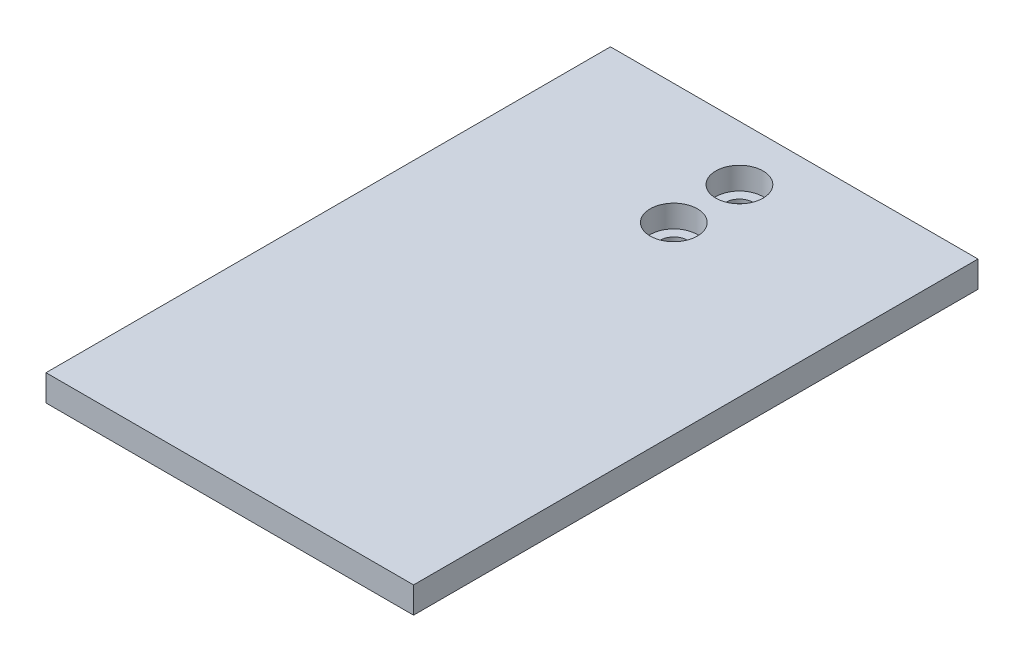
ISO-10303-21;
HEADER;
FILE_DESCRIPTION(('STEP AP214'),'2;1');
FILE_NAME('part.step','',(''),(''),'','','');
FILE_SCHEMA(('AUTOMOTIVE_DESIGN { 1 0 10303 214 1 1 1 1 }'));
ENDSEC;
DATA;
#1=APPLICATION_CONTEXT('core data for automotive mechanical design processes');
#2=APPLICATION_PROTOCOL_DEFINITION('international standard','automotive_design',2000,#1);
#3=PRODUCT_CONTEXT('',#1,'mechanical');
#4=PRODUCT('Part','Part','',(#3));
#5=PRODUCT_RELATED_PRODUCT_CATEGORY('part','',(#4));
#6=PRODUCT_DEFINITION_FORMATION('','',#4);
#7=PRODUCT_DEFINITION_CONTEXT('part definition',#1,'design');
#8=PRODUCT_DEFINITION('design','',#6,#7);
#9=PRODUCT_DEFINITION_SHAPE('','',#8);
#10=(LENGTH_UNIT() NAMED_UNIT(*) SI_UNIT(.MILLI.,.METRE.));
#11=(NAMED_UNIT(*) PLANE_ANGLE_UNIT() SI_UNIT($,.RADIAN.));
#12=(NAMED_UNIT(*) SI_UNIT($,.STERADIAN.) SOLID_ANGLE_UNIT());
#13=UNCERTAINTY_MEASURE_WITH_UNIT(LENGTH_MEASURE(1.E-05),#10,'distance_accuracy_value','');
#14=(GEOMETRIC_REPRESENTATION_CONTEXT(3) GLOBAL_UNCERTAINTY_ASSIGNED_CONTEXT((#13)) GLOBAL_UNIT_ASSIGNED_CONTEXT((#10,
#11,#12)) REPRESENTATION_CONTEXT('',''));
#15=CARTESIAN_POINT('',(0.,0.,0.));
#16=DIRECTION('',(0.,0.,1.));
#17=DIRECTION('',(1.,0.,0.));
#18=AXIS2_PLACEMENT_3D('',#15,#16,#17);
#19=CARTESIAN_POINT('',(0.,-1.,0.));
#20=DIRECTION('',(0.,-1.,0.));
#21=DIRECTION('',(0.,0.,-1.));
#22=AXIS2_PLACEMENT_3D('',#19,#20,#21);
#23=PLANE('',#22);
#24=CARTESIAN_POINT('',(0.,-1.,-24.6519959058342));
#25=DIRECTION('',(0.,-1.,0.));
#26=DIRECTION('',(0.,0.,-1.));
#27=AXIS2_PLACEMENT_3D('',#24,#25,#26);
#28=CIRCLE('',#27,2.1);
#29=CARTESIAN_POINT('',(0.,-1.,-26.7519959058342));
#30=VERTEX_POINT('',#29);
#31=EDGE_CURVE('E123',#30,#30,#28,.T.);
#32=ORIENTED_EDGE('',*,*,#31,.F.);
#33=EDGE_LOOP('',(#32));
#34=FACE_BOUND('',#33,.T.);
#35=CARTESIAN_POINT('',(0.,-1.,-34.6519959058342));
#36=DIRECTION('',(0.,-1.,0.));
#37=DIRECTION('',(0.,0.,-1.));
#38=AXIS2_PLACEMENT_3D('',#35,#36,#37);
#39=CIRCLE('',#38,2.1);
#40=CARTESIAN_POINT('',(0.,-1.,-36.7519959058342));
#41=VERTEX_POINT('',#40);
#42=EDGE_CURVE('E43',#41,#41,#39,.T.);
#43=ORIENTED_EDGE('',*,*,#42,.F.);
#44=EDGE_LOOP('',(#43));
#45=FACE_BOUND('',#44,.T.);
#46=DIRECTION('',(1.,0.,0.));
#47=VECTOR('',#46,1.);
#48=CARTESIAN_POINT('',(0.,-1.,-43.));
#49=LINE('',#48,#47);
#50=CARTESIAN_POINT('',(-28.,-1.,-43.));
#51=VERTEX_POINT('',#50);
#52=CARTESIAN_POINT('',(28.,-1.,-43.));
#53=VERTEX_POINT('',#52);
#54=EDGE_CURVE('E107',#51,#53,#49,.T.);
#55=ORIENTED_EDGE('',*,*,#54,.T.);
#56=DIRECTION('',(0.,0.,1.));
#57=VECTOR('',#56,1.);
#58=CARTESIAN_POINT('',(28.,-1.,0.));
#59=LINE('',#58,#57);
#60=CARTESIAN_POINT('',(28.,-1.,43.));
#61=VERTEX_POINT('',#60);
#62=EDGE_CURVE('E116',#53,#61,#59,.T.);
#63=ORIENTED_EDGE('',*,*,#62,.T.);
#64=DIRECTION('',(-1.,0.,0.));
#65=VECTOR('',#64,1.);
#66=CARTESIAN_POINT('',(0.,-1.,43.));
#67=LINE('',#66,#65);
#68=CARTESIAN_POINT('',(-28.,-1.,43.));
#69=VERTEX_POINT('',#68);
#70=EDGE_CURVE('E114',#61,#69,#67,.T.);
#71=ORIENTED_EDGE('',*,*,#70,.T.);
#72=DIRECTION('',(0.,0.,-1.));
#73=VECTOR('',#72,1.);
#74=CARTESIAN_POINT('',(-28.,-1.,0.));
#75=LINE('',#74,#73);
#76=EDGE_CURVE('E85',#69,#51,#75,.T.);
#77=ORIENTED_EDGE('',*,*,#76,.T.);
#78=EDGE_LOOP('',(#55,#63,#71,#77));
#79=FACE_BOUND('',#78,.T.);
#80=ADVANCED_FACE('F40',(#34,#45,#79),#23,.T.);
#81=CARTESIAN_POINT('',(0.,3.,0.));
#82=DIRECTION('',(0.,-1.,0.));
#83=DIRECTION('',(0.,0.,-1.));
#84=AXIS2_PLACEMENT_3D('',#81,#82,#83);
#85=PLANE('',#84);
#86=CARTESIAN_POINT('',(0.,3.,-24.6519959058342));
#87=DIRECTION('',(0.,1.,0.));
#88=DIRECTION('',(0.,0.,1.));
#89=AXIS2_PLACEMENT_3D('',#86,#87,#88);
#90=CIRCLE('',#89,3.6);
#91=CARTESIAN_POINT('',(0.,3.,-21.0519959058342));
#92=VERTEX_POINT('',#91);
#93=EDGE_CURVE('E128',#92,#92,#90,.T.);
#94=ORIENTED_EDGE('',*,*,#93,.F.);
#95=EDGE_LOOP('',(#94));
#96=FACE_BOUND('',#95,.T.);
#97=CARTESIAN_POINT('',(0.,3.,-34.6519959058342));
#98=DIRECTION('',(0.,1.,0.));
#99=DIRECTION('',(0.,0.,1.));
#100=AXIS2_PLACEMENT_3D('',#97,#98,#99);
#101=CIRCLE('',#100,3.6);
#102=CARTESIAN_POINT('',(0.,3.,-31.0519959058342));
#103=VERTEX_POINT('',#102);
#104=EDGE_CURVE('E48',#103,#103,#101,.T.);
#105=ORIENTED_EDGE('',*,*,#104,.F.);
#106=EDGE_LOOP('',(#105));
#107=FACE_BOUND('',#106,.T.);
#108=DIRECTION('',(0.,0.,-1.));
#109=VECTOR('',#108,1.);
#110=CARTESIAN_POINT('',(28.,3.,43.));
#111=LINE('',#110,#109);
#112=CARTESIAN_POINT('',(28.,3.,43.));
#113=VERTEX_POINT('',#112);
#114=CARTESIAN_POINT('',(28.,3.,-43.));
#115=VERTEX_POINT('',#114);
#116=EDGE_CURVE('E103',#113,#115,#111,.T.);
#117=ORIENTED_EDGE('',*,*,#116,.T.);
#118=DIRECTION('',(-1.,0.,0.));
#119=VECTOR('',#118,1.);
#120=CARTESIAN_POINT('',(-28.,3.,-43.));
#121=LINE('',#120,#119);
#122=CARTESIAN_POINT('',(-28.,3.,-43.));
#123=VERTEX_POINT('',#122);
#124=EDGE_CURVE('E101',#115,#123,#121,.T.);
#125=ORIENTED_EDGE('',*,*,#124,.T.);
#126=DIRECTION('',(0.,0.,1.));
#127=VECTOR('',#126,1.);
#128=CARTESIAN_POINT('',(-28.,3.,43.));
#129=LINE('',#128,#127);
#130=CARTESIAN_POINT('',(-28.,3.,43.));
#131=VERTEX_POINT('',#130);
#132=EDGE_CURVE('E64',#123,#131,#129,.T.);
#133=ORIENTED_EDGE('',*,*,#132,.T.);
#134=DIRECTION('',(1.,0.,0.));
#135=VECTOR('',#134,1.);
#136=CARTESIAN_POINT('',(-28.,3.,43.));
#137=LINE('',#136,#135);
#138=EDGE_CURVE('E92',#131,#113,#137,.T.);
#139=ORIENTED_EDGE('',*,*,#138,.T.);
#140=EDGE_LOOP('',(#117,#125,#133,#139));
#141=FACE_BOUND('',#140,.T.);
#142=ADVANCED_FACE('F100',(#96,#107,#141),#85,.F.);
#143=CARTESIAN_POINT('',(0.,-0.4,-24.6519959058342));
#144=DIRECTION('',(0.,1.,0.));
#145=DIRECTION('',(0.,0.,1.));
#146=AXIS2_PLACEMENT_3D('',#143,#144,#145);
#147=CYLINDRICAL_SURFACE('',#146,3.6);
#148=CARTESIAN_POINT('',(0.,-0.4,-24.6519959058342));
#149=DIRECTION('',(0.,1.,0.));
#150=DIRECTION('',(0.,0.,1.));
#151=AXIS2_PLACEMENT_3D('',#148,#149,#150);
#152=CIRCLE('',#151,3.6);
#153=CARTESIAN_POINT('',(0.,-0.4,-21.0519959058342));
#154=VERTEX_POINT('',#153);
#155=EDGE_CURVE('E131',#154,#154,#152,.T.);
#156=ORIENTED_EDGE('',*,*,#155,.F.);
#157=EDGE_LOOP('',(#156));
#158=FACE_BOUND('',#157,.T.);
#159=ORIENTED_EDGE('',*,*,#93,.T.);
#160=EDGE_LOOP('',(#159));
#161=FACE_BOUND('',#160,.T.);
#162=ADVANCED_FACE('F172',(#158,#161),#147,.F.);
#163=CARTESIAN_POINT('',(0.,-0.4,-24.6519959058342));
#164=DIRECTION('',(0.,1.,0.));
#165=DIRECTION('',(0.,0.,1.));
#166=AXIS2_PLACEMENT_3D('',#163,#164,#165);
#167=PLANE('',#166);
#168=CARTESIAN_POINT('',(0.,-0.4,-24.6519959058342));
#169=DIRECTION('',(0.,1.,0.));
#170=DIRECTION('',(0.,0.,1.));
#171=AXIS2_PLACEMENT_3D('',#168,#169,#170);
#172=CIRCLE('',#171,2.1);
#173=CARTESIAN_POINT('',(0.,-0.4,-22.5519959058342));
#174=VERTEX_POINT('',#173);
#175=EDGE_CURVE('E119',#174,#174,#172,.T.);
#176=ORIENTED_EDGE('',*,*,#175,.F.);
#177=EDGE_LOOP('',(#176));
#178=FACE_BOUND('',#177,.T.);
#179=ORIENTED_EDGE('',*,*,#155,.T.);
#180=EDGE_LOOP('',(#179));
#181=FACE_BOUND('',#180,.T.);
#182=ADVANCED_FACE('F170',(#178,#181),#167,.T.);
#183=CARTESIAN_POINT('',(0.,-0.4,-34.6519959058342));
#184=DIRECTION('',(0.,1.,0.));
#185=DIRECTION('',(0.,0.,1.));
#186=AXIS2_PLACEMENT_3D('',#183,#184,#185);
#187=CYLINDRICAL_SURFACE('',#186,3.6);
#188=CARTESIAN_POINT('',(0.,-0.4,-34.6519959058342));
#189=DIRECTION('',(0.,1.,0.));
#190=DIRECTION('',(0.,0.,1.));
#191=AXIS2_PLACEMENT_3D('',#188,#189,#190);
#192=CIRCLE('',#191,3.6);
#193=CARTESIAN_POINT('',(0.,-0.4,-31.0519959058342));
#194=VERTEX_POINT('',#193);
#195=EDGE_CURVE('E12',#194,#194,#192,.T.);
#196=ORIENTED_EDGE('',*,*,#195,.F.);
#197=EDGE_LOOP('',(#196));
#198=FACE_BOUND('',#197,.T.);
#199=ORIENTED_EDGE('',*,*,#104,.T.);
#200=EDGE_LOOP('',(#199));
#201=FACE_BOUND('',#200,.T.);
#202=ADVANCED_FACE('F166',(#198,#201),#187,.F.);
#203=CARTESIAN_POINT('',(0.,-0.4,-34.6519959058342));
#204=DIRECTION('',(0.,1.,0.));
#205=DIRECTION('',(0.,0.,1.));
#206=AXIS2_PLACEMENT_3D('',#203,#204,#205);
#207=PLANE('',#206);
#208=CARTESIAN_POINT('',(0.,-0.4,-34.6519959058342));
#209=DIRECTION('',(0.,1.,0.));
#210=DIRECTION('',(0.,0.,1.));
#211=AXIS2_PLACEMENT_3D('',#208,#209,#210);
#212=CIRCLE('',#211,2.1);
#213=CARTESIAN_POINT('',(0.,-0.4,-32.5519959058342));
#214=VERTEX_POINT('',#213);
#215=EDGE_CURVE('E120',#214,#214,#212,.T.);
#216=ORIENTED_EDGE('',*,*,#215,.F.);
#217=EDGE_LOOP('',(#216));
#218=FACE_BOUND('',#217,.T.);
#219=ORIENTED_EDGE('',*,*,#195,.T.);
#220=EDGE_LOOP('',(#219));
#221=FACE_BOUND('',#220,.T.);
#222=ADVANCED_FACE('F163',(#218,#221),#207,.T.);
#223=CARTESIAN_POINT('',(0.,-2.4,-24.6519959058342));
#224=DIRECTION('',(0.,1.,0.));
#225=DIRECTION('',(0.,0.,1.));
#226=AXIS2_PLACEMENT_3D('',#223,#224,#225);
#227=CYLINDRICAL_SURFACE('',#226,2.1);
#228=ORIENTED_EDGE('',*,*,#31,.T.);
#229=EDGE_LOOP('',(#228));
#230=FACE_BOUND('',#229,.T.);
#231=ORIENTED_EDGE('',*,*,#175,.T.);
#232=EDGE_LOOP('',(#231));
#233=FACE_BOUND('',#232,.T.);
#234=ADVANCED_FACE('F156',(#230,#233),#227,.F.);
#235=CARTESIAN_POINT('',(0.,-2.4,-34.6519959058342));
#236=DIRECTION('',(0.,1.,0.));
#237=DIRECTION('',(0.,0.,1.));
#238=AXIS2_PLACEMENT_3D('',#235,#236,#237);
#239=CYLINDRICAL_SURFACE('',#238,2.1);
#240=ORIENTED_EDGE('',*,*,#42,.T.);
#241=EDGE_LOOP('',(#240));
#242=FACE_BOUND('',#241,.T.);
#243=ORIENTED_EDGE('',*,*,#215,.T.);
#244=EDGE_LOOP('',(#243));
#245=FACE_BOUND('',#244,.T.);
#246=ADVANCED_FACE('F139',(#242,#245),#239,.F.);
#247=CARTESIAN_POINT('',(28.,-7.,43.));
#248=DIRECTION('',(1.,0.,0.));
#249=DIRECTION('',(0.,0.,-1.));
#250=AXIS2_PLACEMENT_3D('',#247,#248,#249);
#251=PLANE('',#250);
#252=DIRECTION('',(0.,1.,0.));
#253=VECTOR('',#252,1.);
#254=CARTESIAN_POINT('',(28.,-7.,-43.));
#255=LINE('',#254,#253);
#256=EDGE_CURVE('E56',#53,#115,#255,.T.);
#257=ORIENTED_EDGE('',*,*,#256,.T.);
#258=ORIENTED_EDGE('',*,*,#116,.F.);
#259=DIRECTION('',(0.,1.,0.));
#260=VECTOR('',#259,1.);
#261=CARTESIAN_POINT('',(28.,-7.,43.));
#262=LINE('',#261,#260);
#263=EDGE_CURVE('E88',#61,#113,#262,.T.);
#264=ORIENTED_EDGE('',*,*,#263,.F.);
#265=ORIENTED_EDGE('',*,*,#62,.F.);
#266=EDGE_LOOP('',(#257,#258,#264,#265));
#267=FACE_BOUND('',#266,.T.);
#268=ADVANCED_FACE('F147',(#267),#251,.T.);
#269=CARTESIAN_POINT('',(-28.,-7.,43.));
#270=DIRECTION('',(0.,0.,1.));
#271=DIRECTION('',(1.,0.,0.));
#272=AXIS2_PLACEMENT_3D('',#269,#270,#271);
#273=PLANE('',#272);
#274=ORIENTED_EDGE('',*,*,#263,.T.);
#275=ORIENTED_EDGE('',*,*,#138,.F.);
#276=DIRECTION('',(0.,1.,0.));
#277=VECTOR('',#276,1.);
#278=CARTESIAN_POINT('',(-28.,-7.,43.));
#279=LINE('',#278,#277);
#280=EDGE_CURVE('E81',#69,#131,#279,.T.);
#281=ORIENTED_EDGE('',*,*,#280,.F.);
#282=ORIENTED_EDGE('',*,*,#70,.F.);
#283=EDGE_LOOP('',(#274,#275,#281,#282));
#284=FACE_BOUND('',#283,.T.);
#285=ADVANCED_FACE('F93',(#284),#273,.T.);
#286=CARTESIAN_POINT('',(-28.,-7.,43.));
#287=DIRECTION('',(-1.,0.,0.));
#288=DIRECTION('',(0.,0.,1.));
#289=AXIS2_PLACEMENT_3D('',#286,#287,#288);
#290=PLANE('',#289);
#291=ORIENTED_EDGE('',*,*,#280,.T.);
#292=ORIENTED_EDGE('',*,*,#132,.F.);
#293=DIRECTION('',(0.,1.,0.));
#294=VECTOR('',#293,1.);
#295=CARTESIAN_POINT('',(-28.,-7.,-43.));
#296=LINE('',#295,#294);
#297=EDGE_CURVE('E89',#51,#123,#296,.T.);
#298=ORIENTED_EDGE('',*,*,#297,.F.);
#299=ORIENTED_EDGE('',*,*,#76,.F.);
#300=EDGE_LOOP('',(#291,#292,#298,#299));
#301=FACE_BOUND('',#300,.T.);
#302=ADVANCED_FACE('F83',(#301),#290,.T.);
#303=CARTESIAN_POINT('',(-28.,-7.,-43.));
#304=DIRECTION('',(0.,0.,-1.));
#305=DIRECTION('',(-1.,0.,0.));
#306=AXIS2_PLACEMENT_3D('',#303,#304,#305);
#307=PLANE('',#306);
#308=ORIENTED_EDGE('',*,*,#297,.T.);
#309=ORIENTED_EDGE('',*,*,#124,.F.);
#310=ORIENTED_EDGE('',*,*,#256,.F.);
#311=ORIENTED_EDGE('',*,*,#54,.F.);
#312=EDGE_LOOP('',(#308,#309,#310,#311));
#313=FACE_BOUND('',#312,.T.);
#314=ADVANCED_FACE('F145',(#313),#307,.T.);
#315=CLOSED_SHELL('',(#80,#142,#162,#182,#202,#222,#234,#246,#268,#285,#302,#314));
#316=MANIFOLD_SOLID_BREP('B2',#315);
#317=ADVANCED_BREP_SHAPE_REPRESENTATION('',(#18,#316),#14);
#318=SHAPE_DEFINITION_REPRESENTATION(#9,#317);
ENDSEC;
END-ISO-10303-21;
